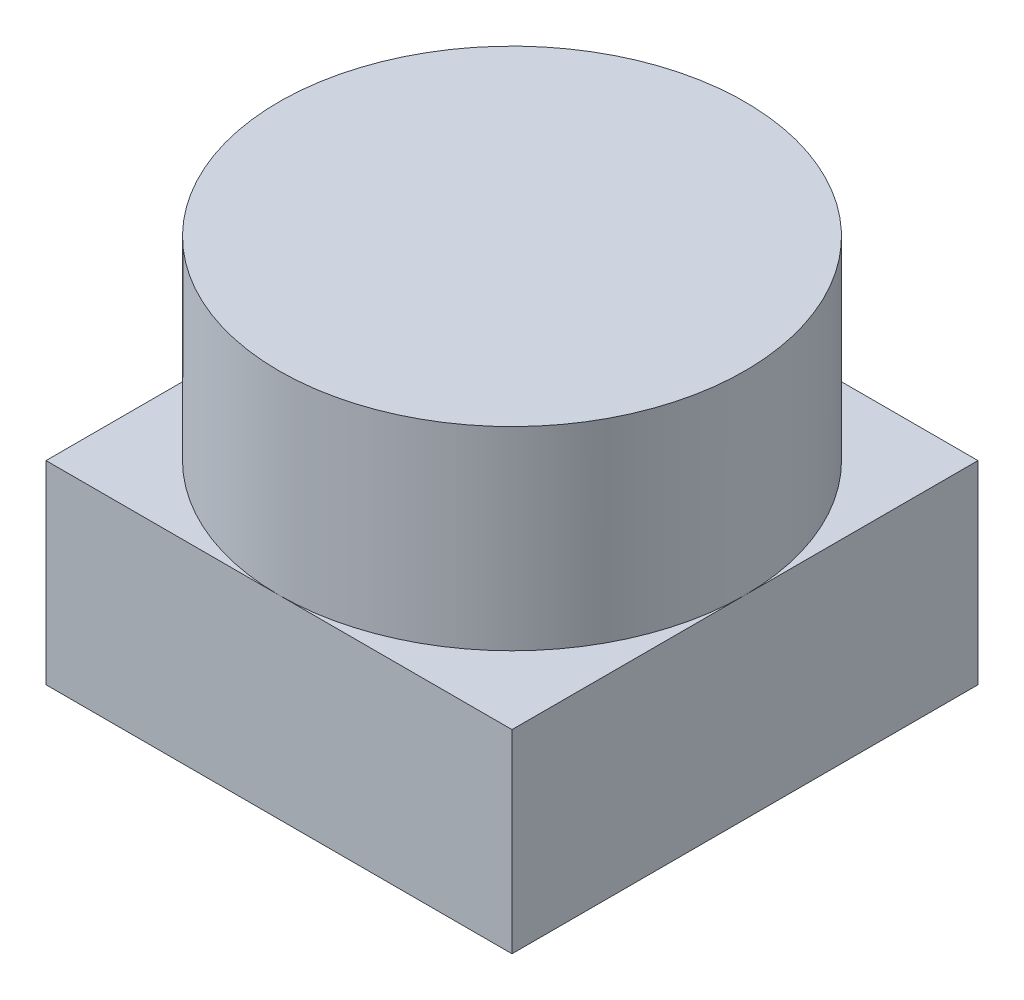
from build123d import *

# Parameters (mm, degrees)
SKETCH1_W           = 12
SKETCH1_H           = 12
BOSS_EXTRUDE1_DEPTH = 5
SKETCH2_R           = 6
BOSS_EXTRUDE2_DEPTH = 5


with BuildPart() as part:
    # Sketch1 → Boss-Extrude1 (new body)
    with BuildSketch(Plane(origin=(0, 0, 0), x_dir=(1, 0, 0), z_dir=(0, 1, 0))):
        with Locations((6, 6)):
            Rectangle(SKETCH1_W, SKETCH1_H)
    extrude(amount=BOSS_EXTRUDE1_DEPTH)

    # Sketch2 → Boss-Extrude2 (add)
    with BuildSketch(Plane(origin=(0, 5, 0), x_dir=(1, 0, 0), z_dir=(0, 1, 0))):
        with Locations(Location((6, 6, 0), (0, 0, 270))):
            Circle(SKETCH2_R)
    extrude(amount=BOSS_EXTRUDE2_DEPTH)


solid = part.part
